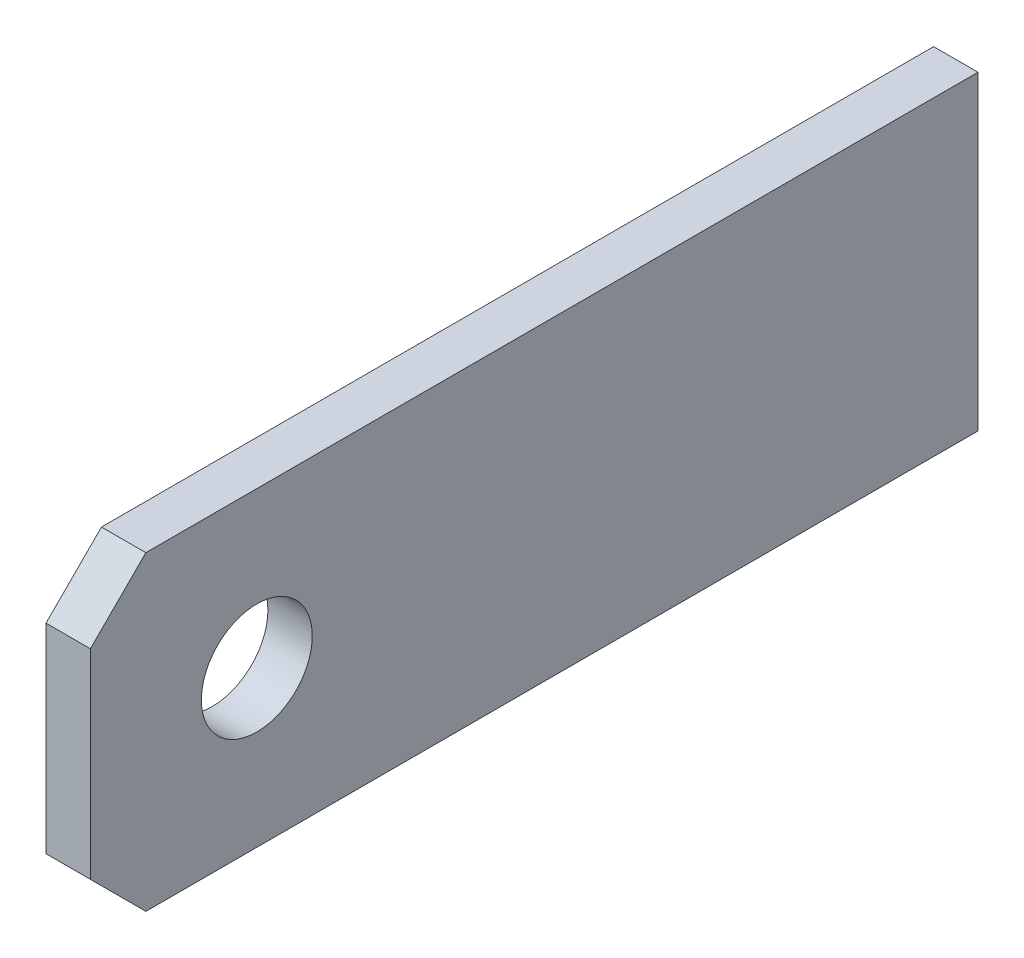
ISO-10303-21;
HEADER;
FILE_DESCRIPTION(('STEP AP214'),'2;1');
FILE_NAME('part.step','',(''),(''),'','','');
FILE_SCHEMA(('AUTOMOTIVE_DESIGN { 1 0 10303 214 1 1 1 1 }'));
ENDSEC;
DATA;
#1=APPLICATION_CONTEXT('core data for automotive mechanical design processes');
#2=APPLICATION_PROTOCOL_DEFINITION('international standard','automotive_design',2000,#1);
#3=PRODUCT_CONTEXT('',#1,'mechanical');
#4=PRODUCT('Part','Part','',(#3));
#5=PRODUCT_RELATED_PRODUCT_CATEGORY('part','',(#4));
#6=PRODUCT_DEFINITION_FORMATION('','',#4);
#7=PRODUCT_DEFINITION_CONTEXT('part definition',#1,'design');
#8=PRODUCT_DEFINITION('design','',#6,#7);
#9=PRODUCT_DEFINITION_SHAPE('','',#8);
#10=(LENGTH_UNIT() NAMED_UNIT(*) SI_UNIT(.MILLI.,.METRE.));
#11=(NAMED_UNIT(*) PLANE_ANGLE_UNIT() SI_UNIT($,.RADIAN.));
#12=(NAMED_UNIT(*) SI_UNIT($,.STERADIAN.) SOLID_ANGLE_UNIT());
#13=UNCERTAINTY_MEASURE_WITH_UNIT(LENGTH_MEASURE(1.E-05),#10,'distance_accuracy_value','');
#14=(GEOMETRIC_REPRESENTATION_CONTEXT(3) GLOBAL_UNCERTAINTY_ASSIGNED_CONTEXT((#13)) GLOBAL_UNIT_ASSIGNED_CONTEXT((#10,
#11,#12)) REPRESENTATION_CONTEXT('',''));
#15=CARTESIAN_POINT('',(0.,0.,0.));
#16=DIRECTION('',(0.,0.,1.));
#17=DIRECTION('',(1.,0.,0.));
#18=AXIS2_PLACEMENT_3D('',#15,#16,#17);
#19=CARTESIAN_POINT('',(-11.7,1.40000000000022,8.));
#20=DIRECTION('',(1.,0.,0.));
#21=DIRECTION('',(0.,1.,0.));
#22=AXIS2_PLACEMENT_3D('',#19,#20,#21);
#23=PLANE('',#22);
#24=CARTESIAN_POINT('',(-11.7,2.17459978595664E-13,6.5));
#25=DIRECTION('',(-1.,0.,0.));
#26=DIRECTION('',(0.,-1.,0.));
#27=AXIS2_PLACEMENT_3D('',#24,#25,#26);
#28=CIRCLE('',#27,0.499999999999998);
#29=CARTESIAN_POINT('',(-11.7,-0.499999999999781,6.5));
#30=VERTEX_POINT('',#29);
#31=EDGE_CURVE('E105',#30,#30,#28,.T.);
#32=ORIENTED_EDGE('',*,*,#31,.F.);
#33=EDGE_LOOP('',(#32));
#34=FACE_BOUND('',#33,.T.);
#35=DIRECTION('',(0.,-1.,0.));
#36=VECTOR('',#35,1.);
#37=CARTESIAN_POINT('',(-11.7,1.40000000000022,8.));
#38=LINE('',#37,#36);
#39=CARTESIAN_POINT('',(-11.7,0.900000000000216,8.));
#40=VERTEX_POINT('',#39);
#41=CARTESIAN_POINT('',(-11.7,-0.899999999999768,8.));
#42=VERTEX_POINT('',#41);
#43=EDGE_CURVE('E112',#40,#42,#38,.T.);
#44=ORIENTED_EDGE('',*,*,#43,.F.);
#45=DIRECTION('',(0.,0.707106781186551,-0.707106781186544));
#46=VECTOR('',#45,1.);
#47=CARTESIAN_POINT('',(-11.7,0.900000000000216,8.));
#48=LINE('',#47,#46);
#49=CARTESIAN_POINT('',(-11.7,1.40000000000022,7.5));
#50=VERTEX_POINT('',#49);
#51=EDGE_CURVE('E129',#40,#50,#48,.T.);
#52=ORIENTED_EDGE('',*,*,#51,.T.);
#53=DIRECTION('',(0.,0.,-1.));
#54=VECTOR('',#53,1.);
#55=CARTESIAN_POINT('',(-11.7,1.40000000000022,8.));
#56=LINE('',#55,#54);
#57=CARTESIAN_POINT('',(-11.7,1.40000000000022,0.));
#58=VERTEX_POINT('',#57);
#59=EDGE_CURVE('E100',#50,#58,#56,.T.);
#60=ORIENTED_EDGE('',*,*,#59,.T.);
#61=DIRECTION('',(0.,-1.,0.));
#62=VECTOR('',#61,1.);
#63=CARTESIAN_POINT('',(-11.7,1.40000000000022,0.));
#64=LINE('',#63,#62);
#65=CARTESIAN_POINT('',(-11.7,-1.39999999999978,0.));
#66=VERTEX_POINT('',#65);
#67=EDGE_CURVE('E95',#58,#66,#64,.T.);
#68=ORIENTED_EDGE('',*,*,#67,.T.);
#69=DIRECTION('',(0.,0.,-1.));
#70=VECTOR('',#69,1.);
#71=CARTESIAN_POINT('',(-11.7,-1.39999999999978,8.));
#72=LINE('',#71,#70);
#73=CARTESIAN_POINT('',(-11.7,-1.39999999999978,7.5));
#74=VERTEX_POINT('',#73);
#75=EDGE_CURVE('E79',#74,#66,#72,.T.);
#76=ORIENTED_EDGE('',*,*,#75,.F.);
#77=DIRECTION('',(0.,0.707106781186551,0.707106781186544));
#78=VECTOR('',#77,1.);
#79=CARTESIAN_POINT('',(-11.7,-0.899999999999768,8.));
#80=LINE('',#79,#78);
#81=EDGE_CURVE('E127',#74,#42,#80,.T.);
#82=ORIENTED_EDGE('',*,*,#81,.T.);
#83=EDGE_LOOP('',(#44,#52,#60,#68,#76,#82));
#84=FACE_BOUND('',#83,.T.);
#85=ADVANCED_FACE('F27',(#34,#84),#23,.F.);
#86=CARTESIAN_POINT('',(-11.7,-1.39999999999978,8.));
#87=DIRECTION('',(0.,1.,0.));
#88=DIRECTION('',(-1.,0.,0.));
#89=AXIS2_PLACEMENT_3D('',#86,#87,#88);
#90=PLANE('',#89);
#91=DIRECTION('',(0.,0.,-1.));
#92=VECTOR('',#91,1.);
#93=CARTESIAN_POINT('',(-11.3,-1.39999999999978,8.));
#94=LINE('',#93,#92);
#95=CARTESIAN_POINT('',(-11.3,-1.39999999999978,7.5));
#96=VERTEX_POINT('',#95);
#97=CARTESIAN_POINT('',(-11.3,-1.39999999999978,0.));
#98=VERTEX_POINT('',#97);
#99=EDGE_CURVE('E89',#96,#98,#94,.T.);
#100=ORIENTED_EDGE('',*,*,#99,.F.);
#101=DIRECTION('',(-1.,0.,0.));
#102=VECTOR('',#101,1.);
#103=CARTESIAN_POINT('',(-11.7,-1.39999999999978,7.5));
#104=LINE('',#103,#102);
#105=EDGE_CURVE('E11',#96,#74,#104,.T.);
#106=ORIENTED_EDGE('',*,*,#105,.T.);
#107=ORIENTED_EDGE('',*,*,#75,.T.);
#108=DIRECTION('',(1.,0.,0.));
#109=VECTOR('',#108,1.);
#110=CARTESIAN_POINT('',(-11.7,-1.39999999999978,0.));
#111=LINE('',#110,#109);
#112=EDGE_CURVE('E82',#66,#98,#111,.T.);
#113=ORIENTED_EDGE('',*,*,#112,.T.);
#114=EDGE_LOOP('',(#100,#106,#107,#113));
#115=FACE_BOUND('',#114,.T.);
#116=ADVANCED_FACE('F81',(#115),#90,.F.);
#117=CARTESIAN_POINT('',(-11.3,-1.39999999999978,8.));
#118=DIRECTION('',(-1.,0.,0.));
#119=DIRECTION('',(0.,-1.,0.));
#120=AXIS2_PLACEMENT_3D('',#117,#118,#119);
#121=PLANE('',#120);
#122=CARTESIAN_POINT('',(-11.2999999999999,2.10025449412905E-13,6.5));
#123=DIRECTION('',(-1.,0.,0.));
#124=DIRECTION('',(0.,-1.,0.));
#125=AXIS2_PLACEMENT_3D('',#122,#123,#124);
#126=CIRCLE('',#125,0.499999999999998);
#127=CARTESIAN_POINT('',(-11.3,-0.499999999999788,6.5));
#128=VERTEX_POINT('',#127);
#129=EDGE_CURVE('E102',#128,#128,#126,.T.);
#130=ORIENTED_EDGE('',*,*,#129,.T.);
#131=EDGE_LOOP('',(#130));
#132=FACE_BOUND('',#131,.T.);
#133=DIRECTION('',(0.,0.,-1.));
#134=VECTOR('',#133,1.);
#135=CARTESIAN_POINT('',(-11.3,1.40000000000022,8.));
#136=LINE('',#135,#134);
#137=CARTESIAN_POINT('',(-11.3,1.40000000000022,7.5));
#138=VERTEX_POINT('',#137);
#139=CARTESIAN_POINT('',(-11.3,1.40000000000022,0.));
#140=VERTEX_POINT('',#139);
#141=EDGE_CURVE('E119',#138,#140,#136,.T.);
#142=ORIENTED_EDGE('',*,*,#141,.F.);
#143=DIRECTION('',(0.,-0.707106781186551,0.707106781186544));
#144=VECTOR('',#143,1.);
#145=CARTESIAN_POINT('',(-11.3,0.900000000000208,8.));
#146=LINE('',#145,#144);
#147=CARTESIAN_POINT('',(-11.3,0.900000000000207,8.));
#148=VERTEX_POINT('',#147);
#149=EDGE_CURVE('E34',#138,#148,#146,.T.);
#150=ORIENTED_EDGE('',*,*,#149,.T.);
#151=DIRECTION('',(0.,1.,0.));
#152=VECTOR('',#151,1.);
#153=CARTESIAN_POINT('',(-11.3,-1.39999999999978,8.));
#154=LINE('',#153,#152);
#155=CARTESIAN_POINT('',(-11.3,-0.899999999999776,8.));
#156=VERTEX_POINT('',#155);
#157=EDGE_CURVE('E115',#156,#148,#154,.T.);
#158=ORIENTED_EDGE('',*,*,#157,.F.);
#159=DIRECTION('',(0.,-0.707106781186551,-0.707106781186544));
#160=VECTOR('',#159,1.);
#161=CARTESIAN_POINT('',(-11.3,-0.899999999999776,8.));
#162=LINE('',#161,#160);
#163=EDGE_CURVE('E41',#156,#96,#162,.T.);
#164=ORIENTED_EDGE('',*,*,#163,.T.);
#165=ORIENTED_EDGE('',*,*,#99,.T.);
#166=DIRECTION('',(0.,1.,0.));
#167=VECTOR('',#166,1.);
#168=CARTESIAN_POINT('',(-11.3,-1.39999999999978,0.));
#169=LINE('',#168,#167);
#170=EDGE_CURVE('E97',#98,#140,#169,.T.);
#171=ORIENTED_EDGE('',*,*,#170,.T.);
#172=EDGE_LOOP('',(#142,#150,#158,#164,#165,#171));
#173=FACE_BOUND('',#172,.T.);
#174=ADVANCED_FACE('F133',(#132,#173),#121,.F.);
#175=CARTESIAN_POINT('',(-11.3,1.40000000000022,8.));
#176=DIRECTION('',(0.,-1.,0.));
#177=DIRECTION('',(1.,0.,0.));
#178=AXIS2_PLACEMENT_3D('',#175,#176,#177);
#179=PLANE('',#178);
#180=ORIENTED_EDGE('',*,*,#59,.F.);
#181=DIRECTION('',(1.,0.,0.));
#182=VECTOR('',#181,1.);
#183=CARTESIAN_POINT('',(-11.3,1.40000000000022,7.5));
#184=LINE('',#183,#182);
#185=EDGE_CURVE('E49',#50,#138,#184,.T.);
#186=ORIENTED_EDGE('',*,*,#185,.T.);
#187=ORIENTED_EDGE('',*,*,#141,.T.);
#188=DIRECTION('',(-1.,0.,0.));
#189=VECTOR('',#188,1.);
#190=CARTESIAN_POINT('',(-11.3,1.40000000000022,0.));
#191=LINE('',#190,#189);
#192=EDGE_CURVE('E110',#140,#58,#191,.T.);
#193=ORIENTED_EDGE('',*,*,#192,.T.);
#194=EDGE_LOOP('',(#180,#186,#187,#193));
#195=FACE_BOUND('',#194,.T.);
#196=ADVANCED_FACE('F140',(#195),#179,.F.);
#197=CARTESIAN_POINT('',(-11.7,-1.39999999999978,8.));
#198=DIRECTION('',(0.,0.,1.));
#199=DIRECTION('',(1.,0.,0.));
#200=AXIS2_PLACEMENT_3D('',#197,#198,#199);
#201=PLANE('',#200);
#202=ORIENTED_EDGE('',*,*,#157,.T.);
#203=DIRECTION('',(-1.,0.,0.));
#204=VECTOR('',#203,1.);
#205=CARTESIAN_POINT('',(-11.7,0.900000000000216,8.));
#206=LINE('',#205,#204);
#207=EDGE_CURVE('E124',#148,#40,#206,.T.);
#208=ORIENTED_EDGE('',*,*,#207,.T.);
#209=ORIENTED_EDGE('',*,*,#43,.T.);
#210=DIRECTION('',(1.,0.,0.));
#211=VECTOR('',#210,1.);
#212=CARTESIAN_POINT('',(-11.3,-0.899999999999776,8.));
#213=LINE('',#212,#211);
#214=EDGE_CURVE('E88',#42,#156,#213,.T.);
#215=ORIENTED_EDGE('',*,*,#214,.T.);
#216=EDGE_LOOP('',(#202,#208,#209,#215));
#217=FACE_BOUND('',#216,.T.);
#218=ADVANCED_FACE('F137',(#217),#201,.T.);
#219=CARTESIAN_POINT('',(-11.7,-1.39999999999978,0.));
#220=DIRECTION('',(0.,0.,1.));
#221=DIRECTION('',(1.,0.,0.));
#222=AXIS2_PLACEMENT_3D('',#219,#220,#221);
#223=PLANE('',#222);
#224=ORIENTED_EDGE('',*,*,#67,.F.);
#225=ORIENTED_EDGE('',*,*,#192,.F.);
#226=ORIENTED_EDGE('',*,*,#170,.F.);
#227=ORIENTED_EDGE('',*,*,#112,.F.);
#228=EDGE_LOOP('',(#224,#225,#226,#227));
#229=FACE_BOUND('',#228,.T.);
#230=ADVANCED_FACE('F93',(#229),#223,.F.);
#231=CARTESIAN_POINT('',(-11.7,0.900000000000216,8.));
#232=DIRECTION('',(0.,0.707106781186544,0.707106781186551));
#233=DIRECTION('',(0.,-0.707106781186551,0.707106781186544));
#234=AXIS2_PLACEMENT_3D('',#231,#232,#233);
#235=PLANE('',#234);
#236=ORIENTED_EDGE('',*,*,#149,.F.);
#237=ORIENTED_EDGE('',*,*,#185,.F.);
#238=ORIENTED_EDGE('',*,*,#51,.F.);
#239=ORIENTED_EDGE('',*,*,#207,.F.);
#240=EDGE_LOOP('',(#236,#237,#238,#239));
#241=FACE_BOUND('',#240,.T.);
#242=ADVANCED_FACE('F139',(#241),#235,.T.);
#243=CARTESIAN_POINT('',(-11.7,-0.899999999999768,8.));
#244=DIRECTION('',(0.,-0.707106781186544,0.707106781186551));
#245=DIRECTION('',(0.,-0.707106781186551,-0.707106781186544));
#246=AXIS2_PLACEMENT_3D('',#243,#244,#245);
#247=PLANE('',#246);
#248=ORIENTED_EDGE('',*,*,#81,.F.);
#249=ORIENTED_EDGE('',*,*,#105,.F.);
#250=ORIENTED_EDGE('',*,*,#163,.F.);
#251=ORIENTED_EDGE('',*,*,#214,.F.);
#252=EDGE_LOOP('',(#248,#249,#250,#251));
#253=FACE_BOUND('',#252,.T.);
#254=ADVANCED_FACE('F142',(#253),#247,.T.);
#255=CARTESIAN_POINT('',(-11.2999999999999,2.10025449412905E-13,6.5));
#256=DIRECTION('',(-1.,0.,0.));
#257=DIRECTION('',(0.,-1.,0.));
#258=AXIS2_PLACEMENT_3D('',#255,#256,#257);
#259=CYLINDRICAL_SURFACE('',#258,0.499999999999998);
#260=ORIENTED_EDGE('',*,*,#129,.F.);
#261=EDGE_LOOP('',(#260));
#262=FACE_BOUND('',#261,.T.);
#263=ORIENTED_EDGE('',*,*,#31,.T.);
#264=EDGE_LOOP('',(#263));
#265=FACE_BOUND('',#264,.T.);
#266=ADVANCED_FACE('F144',(#262,#265),#259,.F.);
#267=CLOSED_SHELL('',(#85,#116,#174,#196,#218,#230,#242,#254,#266));
#268=MANIFOLD_SOLID_BREP('B2',#267);
#269=ADVANCED_BREP_SHAPE_REPRESENTATION('',(#18,#268),#14);
#270=SHAPE_DEFINITION_REPRESENTATION(#9,#269);
ENDSEC;
END-ISO-10303-21;
